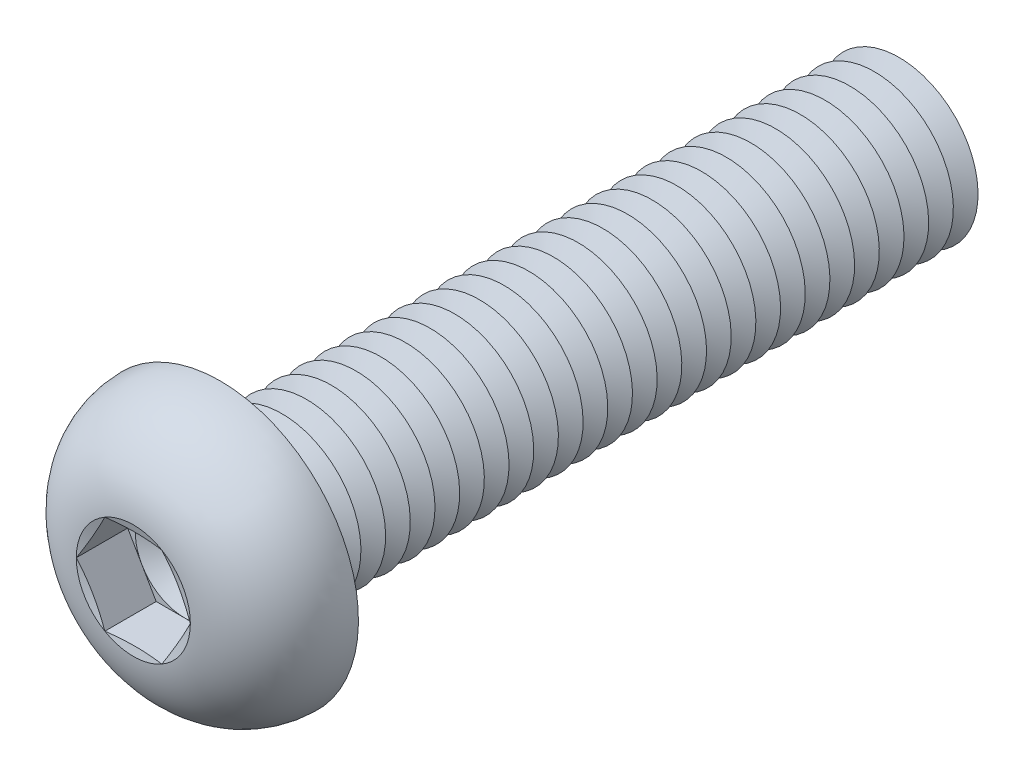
from build123d import *

# Parameters (mm, degrees)
FILLET1_R          = 0.625
LPATTERN1_COUNT    = 28
LPATTERN1_PITCH    = 1.25
CUT_EXTRUDE1_DEPTH = 2.6


with BuildPart() as part:
    # Sketch1 → Revolve1 (revolve)
    with BuildSketch(Plane(origin=(0, 0, 0), x_dir=(0, 0, -1), z_dir=(1, 0, 0))):
        with BuildLine():
            Line((0, 4), (0, 7))
            ThreePointArc((0, 7), (-3.011595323, 5.81154966), (-4.4, 2.88675))
            Line((-4.4, 2.88675), (-4.013248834, 1.443375))
            Line((-4.013248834, 1.443375), (-4.4, 1.443375))
            Line((-4.4, 1.443375), (-4.4, 0))
            Line((-4.4, 0), (35, 0))
            Line((35, 0), (35, 4))
            Line((35, 4), (0, 4))
        make_face()
    revolve(axis=Axis((0, 0, -35), (0, 0, 1)))

    # Fillet1
    fillet1_edges = [part.edges().sort_by_distance(p)[0] for p in [
        (0, -4, 0),
    ]]
    fillet(fillet1_edges, radius=FILLET1_R)

    # Sketch2 → Cut-Revolve1 (revolve, cut)
    with BuildSketch(Plane(origin=(0, 0, 0), x_dir=(0, 0, -1), z_dir=(1, 0, 0))):
        Polygon((34.375, 4), (35.625, 4), (35, 2.917468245), align=None)
    cut_revolve1 = revolve(axis=Axis((0, 0, -35), (0, 0, -1)), mode=Mode.SUBTRACT)

    # LPattern1: Cut-Revolve1 ×28
    with Locations(*[(0, 0, i * LPATTERN1_PITCH) for i in range(1, LPATTERN1_COUNT)]):
        add(cut_revolve1, mode=Mode.SUBTRACT)

    # Sketch3 → Cut-Extrude1 (cut)
    with BuildSketch(Plane.XY.offset(4.4)):
        Polygon((1.443375, 2.499998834), (-1.443375, 2.499998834), (-2.88675, 0), (-1.443375, -2.499998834), (1.443375, -2.499998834), (2.88675, 0), align=None)
    extrude(amount=-CUT_EXTRUDE1_DEPTH, mode=Mode.SUBTRACT)

    # Cut-Extrude2 cone 1 section (on through the dimple's axis) → Cut-Extrude2 (revolve, cut)
    with BuildSketch(Plane(origin=(0, 0, 1.8), x_dir=(0, -1, 0), z_dir=(1, 0, 0))):
        Polygon((0, 0), (2.499998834, 0), (0, 1.443375), align=None)
    revolve(axis=Axis((0, 0, 1.8), (0, 0, -1)), mode=Mode.SUBTRACT)


solid = part.part
